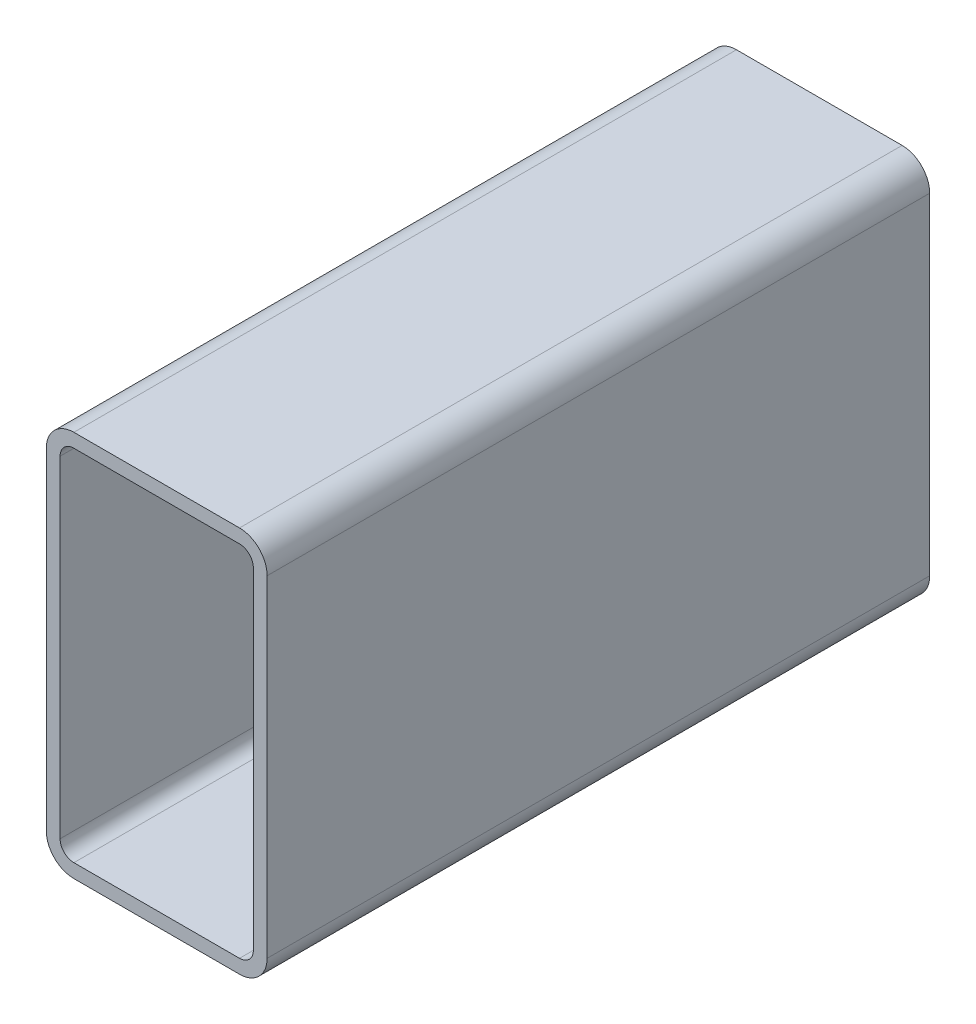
ISO-10303-21;
HEADER;
FILE_DESCRIPTION(('STEP AP214'),'2;1');
FILE_NAME('part.step','',(''),(''),'','','');
FILE_SCHEMA(('AUTOMOTIVE_DESIGN { 1 0 10303 214 1 1 1 1 }'));
ENDSEC;
DATA;
#1=APPLICATION_CONTEXT('core data for automotive mechanical design processes');
#2=APPLICATION_PROTOCOL_DEFINITION('international standard','automotive_design',2000,#1);
#3=PRODUCT_CONTEXT('',#1,'mechanical');
#4=PRODUCT('Part','Part','',(#3));
#5=PRODUCT_RELATED_PRODUCT_CATEGORY('part','',(#4));
#6=PRODUCT_DEFINITION_FORMATION('','',#4);
#7=PRODUCT_DEFINITION_CONTEXT('part definition',#1,'design');
#8=PRODUCT_DEFINITION('design','',#6,#7);
#9=PRODUCT_DEFINITION_SHAPE('','',#8);
#10=(LENGTH_UNIT() NAMED_UNIT(*) SI_UNIT(.MILLI.,.METRE.));
#11=(NAMED_UNIT(*) PLANE_ANGLE_UNIT() SI_UNIT($,.RADIAN.));
#12=(NAMED_UNIT(*) SI_UNIT($,.STERADIAN.) SOLID_ANGLE_UNIT());
#13=UNCERTAINTY_MEASURE_WITH_UNIT(LENGTH_MEASURE(1.E-05),#10,'distance_accuracy_value','');
#14=(GEOMETRIC_REPRESENTATION_CONTEXT(3) GLOBAL_UNCERTAINTY_ASSIGNED_CONTEXT((#13)) GLOBAL_UNIT_ASSIGNED_CONTEXT((#10,
#11,#12)) REPRESENTATION_CONTEXT('',''));
#15=CARTESIAN_POINT('',(0.,0.,0.));
#16=DIRECTION('',(0.,0.,1.));
#17=DIRECTION('',(1.,0.,0.));
#18=AXIS2_PLACEMENT_3D('',#15,#16,#17);
#19=CARTESIAN_POINT('',(14.3751778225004,167.089039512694,304.8));
#20=DIRECTION('',(0.,0.,1.));
#21=DIRECTION('',(1.,0.,0.));
#22=AXIS2_PLACEMENT_3D('',#19,#20,#21);
#23=PLANE('',#22);
#24=CARTESIAN_POINT('',(14.3751778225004,167.089039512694,304.8));
#25=DIRECTION('',(0.,0.,1.));
#26=DIRECTION('',(1.,0.,0.));
#27=AXIS2_PLACEMENT_3D('',#24,#25,#26);
#28=CIRCLE('',#27,12.7);
#29=CARTESIAN_POINT('',(14.3751778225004,179.789039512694,304.8));
#30=VERTEX_POINT('',#29);
#31=CARTESIAN_POINT('',(1.67517782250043,167.089039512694,304.8));
#32=VERTEX_POINT('',#31);
#33=EDGE_CURVE('E211',#30,#32,#28,.T.);
#34=ORIENTED_EDGE('',*,*,#33,.T.);
#35=DIRECTION('',(0.,-1.,0.));
#36=VECTOR('',#35,1.);
#37=CARTESIAN_POINT('',(1.67517782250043,14.6890395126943,304.8));
#38=LINE('',#37,#36);
#39=CARTESIAN_POINT('',(1.67517782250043,14.6890395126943,304.8));
#40=VERTEX_POINT('',#39);
#41=EDGE_CURVE('E214',#32,#40,#38,.T.);
#42=ORIENTED_EDGE('',*,*,#41,.T.);
#43=CARTESIAN_POINT('',(14.3751778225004,14.6890395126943,304.8));
#44=DIRECTION('',(0.,0.,1.));
#45=DIRECTION('',(1.,0.,0.));
#46=AXIS2_PLACEMENT_3D('',#43,#44,#45);
#47=CIRCLE('',#46,12.7);
#48=CARTESIAN_POINT('',(14.3751778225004,1.98903951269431,304.8));
#49=VERTEX_POINT('',#48);
#50=EDGE_CURVE('E217',#40,#49,#47,.T.);
#51=ORIENTED_EDGE('',*,*,#50,.T.);
#52=DIRECTION('',(1.,0.,0.));
#53=VECTOR('',#52,1.);
#54=CARTESIAN_POINT('',(90.5751778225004,1.98903951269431,304.8));
#55=LINE('',#54,#53);
#56=CARTESIAN_POINT('',(90.5751778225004,1.98903951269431,304.8));
#57=VERTEX_POINT('',#56);
#58=EDGE_CURVE('E219',#49,#57,#55,.T.);
#59=ORIENTED_EDGE('',*,*,#58,.T.);
#60=CARTESIAN_POINT('',(90.5751778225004,14.6890395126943,304.8));
#61=DIRECTION('',(0.,0.,1.));
#62=DIRECTION('',(1.,0.,0.));
#63=AXIS2_PLACEMENT_3D('',#60,#61,#62);
#64=CIRCLE('',#63,12.7);
#65=CARTESIAN_POINT('',(103.2751778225,14.6890395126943,304.8));
#66=VERTEX_POINT('',#65);
#67=EDGE_CURVE('E221',#57,#66,#64,.T.);
#68=ORIENTED_EDGE('',*,*,#67,.T.);
#69=DIRECTION('',(0.,1.,0.));
#70=VECTOR('',#69,1.);
#71=CARTESIAN_POINT('',(103.2751778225,167.089039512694,304.8));
#72=LINE('',#71,#70);
#73=CARTESIAN_POINT('',(103.2751778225,167.089039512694,304.8));
#74=VERTEX_POINT('',#73);
#75=EDGE_CURVE('E223',#66,#74,#72,.T.);
#76=ORIENTED_EDGE('',*,*,#75,.T.);
#77=CARTESIAN_POINT('',(90.5751778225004,167.089039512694,304.8));
#78=DIRECTION('',(0.,0.,1.));
#79=DIRECTION('',(1.,0.,0.));
#80=AXIS2_PLACEMENT_3D('',#77,#78,#79);
#81=CIRCLE('',#80,12.7);
#82=CARTESIAN_POINT('',(90.5751778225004,179.789039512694,304.8));
#83=VERTEX_POINT('',#82);
#84=EDGE_CURVE('E225',#74,#83,#81,.T.);
#85=ORIENTED_EDGE('',*,*,#84,.T.);
#86=DIRECTION('',(-1.,0.,0.));
#87=VECTOR('',#86,1.);
#88=CARTESIAN_POINT('',(14.3751778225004,179.789039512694,304.8));
#89=LINE('',#88,#87);
#90=EDGE_CURVE('E227',#83,#30,#89,.T.);
#91=ORIENTED_EDGE('',*,*,#90,.T.);
#92=EDGE_LOOP('',(#34,#42,#51,#59,#68,#76,#85,#91));
#93=FACE_BOUND('',#92,.T.);
#94=DIRECTION('',(0.,-1.,0.));
#95=VECTOR('',#94,1.);
#96=CARTESIAN_POINT('',(8.02517782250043,14.6890395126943,304.8));
#97=LINE('',#96,#95);
#98=CARTESIAN_POINT('',(8.02517782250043,167.089039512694,304.8));
#99=VERTEX_POINT('',#98);
#100=CARTESIAN_POINT('',(8.02517782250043,14.6890395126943,304.8));
#101=VERTEX_POINT('',#100);
#102=EDGE_CURVE('E154',#99,#101,#97,.T.);
#103=ORIENTED_EDGE('',*,*,#102,.F.);
#104=CARTESIAN_POINT('',(14.3751778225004,167.089039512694,304.8));
#105=DIRECTION('',(0.,0.,1.));
#106=DIRECTION('',(1.,0.,0.));
#107=AXIS2_PLACEMENT_3D('',#104,#105,#106);
#108=CIRCLE('',#107,6.35);
#109=CARTESIAN_POINT('',(14.3751778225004,173.439039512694,304.8));
#110=VERTEX_POINT('',#109);
#111=EDGE_CURVE('E146',#110,#99,#108,.T.);
#112=ORIENTED_EDGE('',*,*,#111,.F.);
#113=DIRECTION('',(-1.,0.,0.));
#114=VECTOR('',#113,1.);
#115=CARTESIAN_POINT('',(14.3751778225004,173.439039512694,304.8));
#116=LINE('',#115,#114);
#117=CARTESIAN_POINT('',(90.5751778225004,173.439039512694,304.8));
#118=VERTEX_POINT('',#117);
#119=EDGE_CURVE('E179',#118,#110,#116,.T.);
#120=ORIENTED_EDGE('',*,*,#119,.F.);
#121=CARTESIAN_POINT('',(90.5751778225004,167.089039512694,304.8));
#122=DIRECTION('',(0.,0.,1.));
#123=DIRECTION('',(1.,0.,0.));
#124=AXIS2_PLACEMENT_3D('',#121,#122,#123);
#125=CIRCLE('',#124,6.34999999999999);
#126=CARTESIAN_POINT('',(96.9251778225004,167.089039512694,304.8));
#127=VERTEX_POINT('',#126);
#128=EDGE_CURVE('E177',#127,#118,#125,.T.);
#129=ORIENTED_EDGE('',*,*,#128,.F.);
#130=DIRECTION('',(0.,1.,0.));
#131=VECTOR('',#130,1.);
#132=CARTESIAN_POINT('',(96.9251778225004,167.089039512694,304.8));
#133=LINE('',#132,#131);
#134=CARTESIAN_POINT('',(96.9251778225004,14.6890395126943,304.8));
#135=VERTEX_POINT('',#134);
#136=EDGE_CURVE('E175',#135,#127,#133,.T.);
#137=ORIENTED_EDGE('',*,*,#136,.F.);
#138=CARTESIAN_POINT('',(90.5751778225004,14.6890395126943,304.8));
#139=DIRECTION('',(0.,0.,1.));
#140=DIRECTION('',(1.,0.,0.));
#141=AXIS2_PLACEMENT_3D('',#138,#139,#140);
#142=CIRCLE('',#141,6.35000000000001);
#143=CARTESIAN_POINT('',(90.5751778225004,8.3390395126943,304.8));
#144=VERTEX_POINT('',#143);
#145=EDGE_CURVE('E173',#144,#135,#142,.T.);
#146=ORIENTED_EDGE('',*,*,#145,.F.);
#147=DIRECTION('',(1.,0.,0.));
#148=VECTOR('',#147,1.);
#149=CARTESIAN_POINT('',(90.5751778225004,8.33903951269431,304.8));
#150=LINE('',#149,#148);
#151=CARTESIAN_POINT('',(14.3751778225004,8.33903951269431,304.8));
#152=VERTEX_POINT('',#151);
#153=EDGE_CURVE('E169',#152,#144,#150,.T.);
#154=ORIENTED_EDGE('',*,*,#153,.F.);
#155=CARTESIAN_POINT('',(14.3751778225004,14.6890395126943,304.8));
#156=DIRECTION('',(0.,0.,1.));
#157=DIRECTION('',(1.,0.,0.));
#158=AXIS2_PLACEMENT_3D('',#155,#156,#157);
#159=CIRCLE('',#158,6.35);
#160=EDGE_CURVE('E167',#101,#152,#159,.T.);
#161=ORIENTED_EDGE('',*,*,#160,.F.);
#162=EDGE_LOOP('',(#103,#112,#120,#129,#137,#146,#154,#161));
#163=FACE_BOUND('',#162,.T.);
#164=ADVANCED_FACE('F33',(#93,#163),#23,.T.);
#165=CARTESIAN_POINT('',(14.3751778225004,167.089039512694,0.));
#166=DIRECTION('',(0.,0.,1.));
#167=DIRECTION('',(1.,0.,0.));
#168=AXIS2_PLACEMENT_3D('',#165,#166,#167);
#169=PLANE('',#168);
#170=CARTESIAN_POINT('',(14.3751778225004,167.089039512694,0.));
#171=DIRECTION('',(0.,0.,1.));
#172=DIRECTION('',(1.,0.,0.));
#173=AXIS2_PLACEMENT_3D('',#170,#171,#172);
#174=CIRCLE('',#173,12.7);
#175=CARTESIAN_POINT('',(14.3751778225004,179.789039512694,0.));
#176=VERTEX_POINT('',#175);
#177=CARTESIAN_POINT('',(1.67517782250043,167.089039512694,0.));
#178=VERTEX_POINT('',#177);
#179=EDGE_CURVE('E162',#176,#178,#174,.T.);
#180=ORIENTED_EDGE('',*,*,#179,.F.);
#181=DIRECTION('',(-1.,0.,0.));
#182=VECTOR('',#181,1.);
#183=CARTESIAN_POINT('',(14.3751778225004,179.789039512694,0.));
#184=LINE('',#183,#182);
#185=CARTESIAN_POINT('',(90.5751778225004,179.789039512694,0.));
#186=VERTEX_POINT('',#185);
#187=EDGE_CURVE('E215',#186,#176,#184,.T.);
#188=ORIENTED_EDGE('',*,*,#187,.F.);
#189=CARTESIAN_POINT('',(90.5751778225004,167.089039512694,0.));
#190=DIRECTION('',(0.,0.,1.));
#191=DIRECTION('',(1.,0.,0.));
#192=AXIS2_PLACEMENT_3D('',#189,#190,#191);
#193=CIRCLE('',#192,12.7);
#194=CARTESIAN_POINT('',(103.2751778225,167.089039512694,0.));
#195=VERTEX_POINT('',#194);
#196=EDGE_CURVE('E242',#195,#186,#193,.T.);
#197=ORIENTED_EDGE('',*,*,#196,.F.);
#198=DIRECTION('',(0.,1.,0.));
#199=VECTOR('',#198,1.);
#200=CARTESIAN_POINT('',(103.2751778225,167.089039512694,0.));
#201=LINE('',#200,#199);
#202=CARTESIAN_POINT('',(103.2751778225,14.6890395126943,0.));
#203=VERTEX_POINT('',#202);
#204=EDGE_CURVE('E240',#203,#195,#201,.T.);
#205=ORIENTED_EDGE('',*,*,#204,.F.);
#206=CARTESIAN_POINT('',(90.5751778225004,14.6890395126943,0.));
#207=DIRECTION('',(0.,0.,1.));
#208=DIRECTION('',(1.,0.,0.));
#209=AXIS2_PLACEMENT_3D('',#206,#207,#208);
#210=CIRCLE('',#209,12.7);
#211=CARTESIAN_POINT('',(90.5751778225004,1.98903951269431,0.));
#212=VERTEX_POINT('',#211);
#213=EDGE_CURVE('E238',#212,#203,#210,.T.);
#214=ORIENTED_EDGE('',*,*,#213,.F.);
#215=DIRECTION('',(1.,0.,0.));
#216=VECTOR('',#215,1.);
#217=CARTESIAN_POINT('',(90.5751778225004,1.98903951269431,0.));
#218=LINE('',#217,#216);
#219=CARTESIAN_POINT('',(14.3751778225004,1.98903951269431,0.));
#220=VERTEX_POINT('',#219);
#221=EDGE_CURVE('E236',#220,#212,#218,.T.);
#222=ORIENTED_EDGE('',*,*,#221,.F.);
#223=CARTESIAN_POINT('',(14.3751778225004,14.6890395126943,0.));
#224=DIRECTION('',(0.,0.,1.));
#225=DIRECTION('',(1.,0.,0.));
#226=AXIS2_PLACEMENT_3D('',#223,#224,#225);
#227=CIRCLE('',#226,12.7);
#228=CARTESIAN_POINT('',(1.67517782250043,14.6890395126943,0.));
#229=VERTEX_POINT('',#228);
#230=EDGE_CURVE('E234',#229,#220,#227,.T.);
#231=ORIENTED_EDGE('',*,*,#230,.F.);
#232=DIRECTION('',(0.,-1.,0.));
#233=VECTOR('',#232,1.);
#234=CARTESIAN_POINT('',(1.67517782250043,14.6890395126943,0.));
#235=LINE('',#234,#233);
#236=EDGE_CURVE('E232',#178,#229,#235,.T.);
#237=ORIENTED_EDGE('',*,*,#236,.F.);
#238=EDGE_LOOP('',(#180,#188,#197,#205,#214,#222,#231,#237));
#239=FACE_BOUND('',#238,.T.);
#240=CARTESIAN_POINT('',(14.3751778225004,167.089039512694,0.));
#241=DIRECTION('',(0.,0.,1.));
#242=DIRECTION('',(1.,0.,0.));
#243=AXIS2_PLACEMENT_3D('',#240,#241,#242);
#244=CIRCLE('',#243,6.35);
#245=CARTESIAN_POINT('',(14.3751778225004,173.439039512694,0.));
#246=VERTEX_POINT('',#245);
#247=CARTESIAN_POINT('',(8.02517782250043,167.089039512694,0.));
#248=VERTEX_POINT('',#247);
#249=EDGE_CURVE('E56',#246,#248,#244,.T.);
#250=ORIENTED_EDGE('',*,*,#249,.T.);
#251=DIRECTION('',(0.,-1.,0.));
#252=VECTOR('',#251,1.);
#253=CARTESIAN_POINT('',(8.02517782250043,14.6890395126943,0.));
#254=LINE('',#253,#252);
#255=CARTESIAN_POINT('',(8.02517782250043,14.6890395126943,0.));
#256=VERTEX_POINT('',#255);
#257=EDGE_CURVE('E161',#248,#256,#254,.T.);
#258=ORIENTED_EDGE('',*,*,#257,.T.);
#259=CARTESIAN_POINT('',(14.3751778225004,14.6890395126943,0.));
#260=DIRECTION('',(0.,0.,1.));
#261=DIRECTION('',(1.,0.,0.));
#262=AXIS2_PLACEMENT_3D('',#259,#260,#261);
#263=CIRCLE('',#262,6.35);
#264=CARTESIAN_POINT('',(14.3751778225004,8.33903951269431,0.));
#265=VERTEX_POINT('',#264);
#266=EDGE_CURVE('E183',#256,#265,#263,.T.);
#267=ORIENTED_EDGE('',*,*,#266,.T.);
#268=DIRECTION('',(1.,0.,0.));
#269=VECTOR('',#268,1.);
#270=CARTESIAN_POINT('',(90.5751778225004,8.33903951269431,0.));
#271=LINE('',#270,#269);
#272=CARTESIAN_POINT('',(90.5751778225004,8.3390395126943,0.));
#273=VERTEX_POINT('',#272);
#274=EDGE_CURVE('E186',#265,#273,#271,.T.);
#275=ORIENTED_EDGE('',*,*,#274,.T.);
#276=CARTESIAN_POINT('',(90.5751778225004,14.6890395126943,0.));
#277=DIRECTION('',(0.,0.,1.));
#278=DIRECTION('',(1.,0.,0.));
#279=AXIS2_PLACEMENT_3D('',#276,#277,#278);
#280=CIRCLE('',#279,6.35000000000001);
#281=CARTESIAN_POINT('',(96.9251778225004,14.6890395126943,0.));
#282=VERTEX_POINT('',#281);
#283=EDGE_CURVE('E189',#273,#282,#280,.T.);
#284=ORIENTED_EDGE('',*,*,#283,.T.);
#285=DIRECTION('',(0.,1.,0.));
#286=VECTOR('',#285,1.);
#287=CARTESIAN_POINT('',(96.9251778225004,167.089039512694,0.));
#288=LINE('',#287,#286);
#289=CARTESIAN_POINT('',(96.9251778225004,167.089039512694,0.));
#290=VERTEX_POINT('',#289);
#291=EDGE_CURVE('E192',#282,#290,#288,.T.);
#292=ORIENTED_EDGE('',*,*,#291,.T.);
#293=CARTESIAN_POINT('',(90.5751778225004,167.089039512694,0.));
#294=DIRECTION('',(0.,0.,1.));
#295=DIRECTION('',(1.,0.,0.));
#296=AXIS2_PLACEMENT_3D('',#293,#294,#295);
#297=CIRCLE('',#296,6.34999999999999);
#298=CARTESIAN_POINT('',(90.5751778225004,173.439039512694,0.));
#299=VERTEX_POINT('',#298);
#300=EDGE_CURVE('E195',#290,#299,#297,.T.);
#301=ORIENTED_EDGE('',*,*,#300,.T.);
#302=DIRECTION('',(-1.,0.,0.));
#303=VECTOR('',#302,1.);
#304=CARTESIAN_POINT('',(14.3751778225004,173.439039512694,0.));
#305=LINE('',#304,#303);
#306=EDGE_CURVE('E155',#299,#246,#305,.T.);
#307=ORIENTED_EDGE('',*,*,#306,.T.);
#308=EDGE_LOOP('',(#250,#258,#267,#275,#284,#292,#301,#307));
#309=FACE_BOUND('',#308,.T.);
#310=ADVANCED_FACE('F272',(#239,#309),#169,.F.);
#311=CARTESIAN_POINT('',(14.3751778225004,167.089039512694,304.8));
#312=DIRECTION('',(0.,0.,-1.));
#313=DIRECTION('',(-1.,0.,0.));
#314=AXIS2_PLACEMENT_3D('',#311,#312,#313);
#315=CYLINDRICAL_SURFACE('',#314,12.7);
#316=ORIENTED_EDGE('',*,*,#179,.T.);
#317=DIRECTION('',(0.,0.,-1.));
#318=VECTOR('',#317,1.);
#319=CARTESIAN_POINT('',(1.67517782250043,167.089039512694,304.8));
#320=LINE('',#319,#318);
#321=EDGE_CURVE('E11',#32,#178,#320,.T.);
#322=ORIENTED_EDGE('',*,*,#321,.F.);
#323=ORIENTED_EDGE('',*,*,#33,.F.);
#324=DIRECTION('',(0.,0.,-1.));
#325=VECTOR('',#324,1.);
#326=CARTESIAN_POINT('',(14.3751778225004,179.789039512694,304.8));
#327=LINE('',#326,#325);
#328=EDGE_CURVE('E229',#30,#176,#327,.T.);
#329=ORIENTED_EDGE('',*,*,#328,.T.);
#330=EDGE_LOOP('',(#316,#322,#323,#329));
#331=FACE_BOUND('',#330,.T.);
#332=ADVANCED_FACE('F35',(#331),#315,.T.);
#333=CARTESIAN_POINT('',(1.67517782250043,14.6890395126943,304.8));
#334=DIRECTION('',(1.,0.,0.));
#335=DIRECTION('',(0.,0.,-1.));
#336=AXIS2_PLACEMENT_3D('',#333,#334,#335);
#337=PLANE('',#336);
#338=ORIENTED_EDGE('',*,*,#236,.T.);
#339=DIRECTION('',(0.,0.,-1.));
#340=VECTOR('',#339,1.);
#341=CARTESIAN_POINT('',(1.67517782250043,14.6890395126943,304.8));
#342=LINE('',#341,#340);
#343=EDGE_CURVE('E41',#40,#229,#342,.T.);
#344=ORIENTED_EDGE('',*,*,#343,.F.);
#345=ORIENTED_EDGE('',*,*,#41,.F.);
#346=ORIENTED_EDGE('',*,*,#321,.T.);
#347=EDGE_LOOP('',(#338,#344,#345,#346));
#348=FACE_BOUND('',#347,.T.);
#349=ADVANCED_FACE('F289',(#348),#337,.F.);
#350=CARTESIAN_POINT('',(14.3751778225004,14.6890395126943,304.8));
#351=DIRECTION('',(0.,0.,-1.));
#352=DIRECTION('',(-1.,0.,0.));
#353=AXIS2_PLACEMENT_3D('',#350,#351,#352);
#354=CYLINDRICAL_SURFACE('',#353,12.7);
#355=ORIENTED_EDGE('',*,*,#230,.T.);
#356=DIRECTION('',(0.,0.,-1.));
#357=VECTOR('',#356,1.);
#358=CARTESIAN_POINT('',(14.3751778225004,1.98903951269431,304.8));
#359=LINE('',#358,#357);
#360=EDGE_CURVE('E259',#49,#220,#359,.T.);
#361=ORIENTED_EDGE('',*,*,#360,.F.);
#362=ORIENTED_EDGE('',*,*,#50,.F.);
#363=ORIENTED_EDGE('',*,*,#343,.T.);
#364=EDGE_LOOP('',(#355,#361,#362,#363));
#365=FACE_BOUND('',#364,.T.);
#366=ADVANCED_FACE('F266',(#365),#354,.T.);
#367=CARTESIAN_POINT('',(90.5751778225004,1.98903951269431,304.8));
#368=DIRECTION('',(0.,1.,0.));
#369=DIRECTION('',(0.,0.,1.));
#370=AXIS2_PLACEMENT_3D('',#367,#368,#369);
#371=PLANE('',#370);
#372=ORIENTED_EDGE('',*,*,#221,.T.);
#373=DIRECTION('',(0.,0.,-1.));
#374=VECTOR('',#373,1.);
#375=CARTESIAN_POINT('',(90.5751778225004,1.98903951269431,304.8));
#376=LINE('',#375,#374);
#377=EDGE_CURVE('E256',#57,#212,#376,.T.);
#378=ORIENTED_EDGE('',*,*,#377,.F.);
#379=ORIENTED_EDGE('',*,*,#58,.F.);
#380=ORIENTED_EDGE('',*,*,#360,.T.);
#381=EDGE_LOOP('',(#372,#378,#379,#380));
#382=FACE_BOUND('',#381,.T.);
#383=ADVANCED_FACE('F278',(#382),#371,.F.);
#384=CARTESIAN_POINT('',(90.5751778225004,14.6890395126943,304.8));
#385=DIRECTION('',(0.,0.,-1.));
#386=DIRECTION('',(-1.,0.,0.));
#387=AXIS2_PLACEMENT_3D('',#384,#385,#386);
#388=CYLINDRICAL_SURFACE('',#387,12.7);
#389=ORIENTED_EDGE('',*,*,#213,.T.);
#390=DIRECTION('',(0.,0.,-1.));
#391=VECTOR('',#390,1.);
#392=CARTESIAN_POINT('',(103.2751778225,14.6890395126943,304.8));
#393=LINE('',#392,#391);
#394=EDGE_CURVE('E253',#66,#203,#393,.T.);
#395=ORIENTED_EDGE('',*,*,#394,.F.);
#396=ORIENTED_EDGE('',*,*,#67,.F.);
#397=ORIENTED_EDGE('',*,*,#377,.T.);
#398=EDGE_LOOP('',(#389,#395,#396,#397));
#399=FACE_BOUND('',#398,.T.);
#400=ADVANCED_FACE('F282',(#399),#388,.T.);
#401=CARTESIAN_POINT('',(103.2751778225,167.089039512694,304.8));
#402=DIRECTION('',(-1.,0.,0.));
#403=DIRECTION('',(0.,0.,1.));
#404=AXIS2_PLACEMENT_3D('',#401,#402,#403);
#405=PLANE('',#404);
#406=ORIENTED_EDGE('',*,*,#204,.T.);
#407=DIRECTION('',(0.,0.,-1.));
#408=VECTOR('',#407,1.);
#409=CARTESIAN_POINT('',(103.2751778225,167.089039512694,304.8));
#410=LINE('',#409,#408);
#411=EDGE_CURVE('E250',#74,#195,#410,.T.);
#412=ORIENTED_EDGE('',*,*,#411,.F.);
#413=ORIENTED_EDGE('',*,*,#75,.F.);
#414=ORIENTED_EDGE('',*,*,#394,.T.);
#415=EDGE_LOOP('',(#406,#412,#413,#414));
#416=FACE_BOUND('',#415,.T.);
#417=ADVANCED_FACE('F302',(#416),#405,.F.);
#418=CARTESIAN_POINT('',(90.5751778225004,167.089039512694,304.8));
#419=DIRECTION('',(0.,0.,-1.));
#420=DIRECTION('',(-1.,0.,0.));
#421=AXIS2_PLACEMENT_3D('',#418,#419,#420);
#422=CYLINDRICAL_SURFACE('',#421,12.7);
#423=ORIENTED_EDGE('',*,*,#196,.T.);
#424=DIRECTION('',(0.,0.,-1.));
#425=VECTOR('',#424,1.);
#426=CARTESIAN_POINT('',(90.5751778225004,179.789039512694,304.8));
#427=LINE('',#426,#425);
#428=EDGE_CURVE('E247',#83,#186,#427,.T.);
#429=ORIENTED_EDGE('',*,*,#428,.F.);
#430=ORIENTED_EDGE('',*,*,#84,.F.);
#431=ORIENTED_EDGE('',*,*,#411,.T.);
#432=EDGE_LOOP('',(#423,#429,#430,#431));
#433=FACE_BOUND('',#432,.T.);
#434=ADVANCED_FACE('F300',(#433),#422,.T.);
#435=CARTESIAN_POINT('',(14.3751778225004,179.789039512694,304.8));
#436=DIRECTION('',(0.,-1.,0.));
#437=DIRECTION('',(0.,0.,-1.));
#438=AXIS2_PLACEMENT_3D('',#435,#436,#437);
#439=PLANE('',#438);
#440=ORIENTED_EDGE('',*,*,#187,.T.);
#441=ORIENTED_EDGE('',*,*,#328,.F.);
#442=ORIENTED_EDGE('',*,*,#90,.F.);
#443=ORIENTED_EDGE('',*,*,#428,.T.);
#444=EDGE_LOOP('',(#440,#441,#442,#443));
#445=FACE_BOUND('',#444,.T.);
#446=ADVANCED_FACE('F295',(#445),#439,.F.);
#447=CARTESIAN_POINT('',(14.3751778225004,167.089039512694,304.8));
#448=DIRECTION('',(0.,0.,-1.));
#449=DIRECTION('',(-1.,0.,0.));
#450=AXIS2_PLACEMENT_3D('',#447,#448,#449);
#451=CYLINDRICAL_SURFACE('',#450,6.35);
#452=ORIENTED_EDGE('',*,*,#249,.F.);
#453=DIRECTION('',(0.,0.,-1.));
#454=VECTOR('',#453,1.);
#455=CARTESIAN_POINT('',(14.3751778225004,173.439039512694,304.8));
#456=LINE('',#455,#454);
#457=EDGE_CURVE('E150',#110,#246,#456,.T.);
#458=ORIENTED_EDGE('',*,*,#457,.F.);
#459=ORIENTED_EDGE('',*,*,#111,.T.);
#460=DIRECTION('',(0.,0.,-1.));
#461=VECTOR('',#460,1.);
#462=CARTESIAN_POINT('',(8.02517782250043,167.089039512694,304.8));
#463=LINE('',#462,#461);
#464=EDGE_CURVE('E149',#99,#248,#463,.T.);
#465=ORIENTED_EDGE('',*,*,#464,.T.);
#466=EDGE_LOOP('',(#452,#458,#459,#465));
#467=FACE_BOUND('',#466,.T.);
#468=ADVANCED_FACE('F148',(#467),#451,.F.);
#469=CARTESIAN_POINT('',(8.02517782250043,14.6890395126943,304.8));
#470=DIRECTION('',(1.,0.,0.));
#471=DIRECTION('',(0.,0.,-1.));
#472=AXIS2_PLACEMENT_3D('',#469,#470,#471);
#473=PLANE('',#472);
#474=ORIENTED_EDGE('',*,*,#257,.F.);
#475=ORIENTED_EDGE('',*,*,#464,.F.);
#476=ORIENTED_EDGE('',*,*,#102,.T.);
#477=DIRECTION('',(0.,0.,-1.));
#478=VECTOR('',#477,1.);
#479=CARTESIAN_POINT('',(8.02517782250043,14.6890395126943,304.8));
#480=LINE('',#479,#478);
#481=EDGE_CURVE('E163',#101,#256,#480,.T.);
#482=ORIENTED_EDGE('',*,*,#481,.T.);
#483=EDGE_LOOP('',(#474,#475,#476,#482));
#484=FACE_BOUND('',#483,.T.);
#485=ADVANCED_FACE('F158',(#484),#473,.T.);
#486=CARTESIAN_POINT('',(14.3751778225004,14.6890395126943,304.8));
#487=DIRECTION('',(0.,0.,-1.));
#488=DIRECTION('',(-1.,0.,0.));
#489=AXIS2_PLACEMENT_3D('',#486,#487,#488);
#490=CYLINDRICAL_SURFACE('',#489,6.35);
#491=ORIENTED_EDGE('',*,*,#266,.F.);
#492=ORIENTED_EDGE('',*,*,#481,.F.);
#493=ORIENTED_EDGE('',*,*,#160,.T.);
#494=DIRECTION('',(0.,0.,-1.));
#495=VECTOR('',#494,1.);
#496=CARTESIAN_POINT('',(14.3751778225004,8.33903951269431,304.8));
#497=LINE('',#496,#495);
#498=EDGE_CURVE('E208',#152,#265,#497,.T.);
#499=ORIENTED_EDGE('',*,*,#498,.T.);
#500=EDGE_LOOP('',(#491,#492,#493,#499));
#501=FACE_BOUND('',#500,.T.);
#502=ADVANCED_FACE('F327',(#501),#490,.F.);
#503=CARTESIAN_POINT('',(90.5751778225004,8.33903951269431,304.8));
#504=DIRECTION('',(0.,1.,0.));
#505=DIRECTION('',(0.,0.,1.));
#506=AXIS2_PLACEMENT_3D('',#503,#504,#505);
#507=PLANE('',#506);
#508=ORIENTED_EDGE('',*,*,#274,.F.);
#509=ORIENTED_EDGE('',*,*,#498,.F.);
#510=ORIENTED_EDGE('',*,*,#153,.T.);
#511=DIRECTION('',(0.,0.,-1.));
#512=VECTOR('',#511,1.);
#513=CARTESIAN_POINT('',(90.5751778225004,8.3390395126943,304.8));
#514=LINE('',#513,#512);
#515=EDGE_CURVE('E206',#144,#273,#514,.T.);
#516=ORIENTED_EDGE('',*,*,#515,.T.);
#517=EDGE_LOOP('',(#508,#509,#510,#516));
#518=FACE_BOUND('',#517,.T.);
#519=ADVANCED_FACE('F331',(#518),#507,.T.);
#520=CARTESIAN_POINT('',(90.5751778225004,14.6890395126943,304.8));
#521=DIRECTION('',(0.,0.,-1.));
#522=DIRECTION('',(-1.,0.,0.));
#523=AXIS2_PLACEMENT_3D('',#520,#521,#522);
#524=CYLINDRICAL_SURFACE('',#523,6.35000000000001);
#525=ORIENTED_EDGE('',*,*,#283,.F.);
#526=ORIENTED_EDGE('',*,*,#515,.F.);
#527=ORIENTED_EDGE('',*,*,#145,.T.);
#528=DIRECTION('',(0.,0.,-1.));
#529=VECTOR('',#528,1.);
#530=CARTESIAN_POINT('',(96.9251778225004,14.6890395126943,304.8));
#531=LINE('',#530,#529);
#532=EDGE_CURVE('E204',#135,#282,#531,.T.);
#533=ORIENTED_EDGE('',*,*,#532,.T.);
#534=EDGE_LOOP('',(#525,#526,#527,#533));
#535=FACE_BOUND('',#534,.T.);
#536=ADVANCED_FACE('F337',(#535),#524,.F.);
#537=CARTESIAN_POINT('',(96.9251778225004,167.089039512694,304.8));
#538=DIRECTION('',(-1.,0.,0.));
#539=DIRECTION('',(0.,0.,1.));
#540=AXIS2_PLACEMENT_3D('',#537,#538,#539);
#541=PLANE('',#540);
#542=ORIENTED_EDGE('',*,*,#291,.F.);
#543=ORIENTED_EDGE('',*,*,#532,.F.);
#544=ORIENTED_EDGE('',*,*,#136,.T.);
#545=DIRECTION('',(0.,0.,-1.));
#546=VECTOR('',#545,1.);
#547=CARTESIAN_POINT('',(96.9251778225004,167.089039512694,304.8));
#548=LINE('',#547,#546);
#549=EDGE_CURVE('E202',#127,#290,#548,.T.);
#550=ORIENTED_EDGE('',*,*,#549,.T.);
#551=EDGE_LOOP('',(#542,#543,#544,#550));
#552=FACE_BOUND('',#551,.T.);
#553=ADVANCED_FACE('F341',(#552),#541,.T.);
#554=CARTESIAN_POINT('',(90.5751778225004,167.089039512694,304.8));
#555=DIRECTION('',(0.,0.,-1.));
#556=DIRECTION('',(-1.,0.,0.));
#557=AXIS2_PLACEMENT_3D('',#554,#555,#556);
#558=CYLINDRICAL_SURFACE('',#557,6.34999999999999);
#559=ORIENTED_EDGE('',*,*,#300,.F.);
#560=ORIENTED_EDGE('',*,*,#549,.F.);
#561=ORIENTED_EDGE('',*,*,#128,.T.);
#562=DIRECTION('',(0.,0.,-1.));
#563=VECTOR('',#562,1.);
#564=CARTESIAN_POINT('',(90.5751778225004,173.439039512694,304.8));
#565=LINE('',#564,#563);
#566=EDGE_CURVE('E48',#118,#299,#565,.T.);
#567=ORIENTED_EDGE('',*,*,#566,.T.);
#568=EDGE_LOOP('',(#559,#560,#561,#567));
#569=FACE_BOUND('',#568,.T.);
#570=ADVANCED_FACE('F345',(#569),#558,.F.);
#571=CARTESIAN_POINT('',(14.3751778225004,173.439039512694,304.8));
#572=DIRECTION('',(0.,-1.,0.));
#573=DIRECTION('',(0.,0.,-1.));
#574=AXIS2_PLACEMENT_3D('',#571,#572,#573);
#575=PLANE('',#574);
#576=ORIENTED_EDGE('',*,*,#306,.F.);
#577=ORIENTED_EDGE('',*,*,#566,.F.);
#578=ORIENTED_EDGE('',*,*,#119,.T.);
#579=ORIENTED_EDGE('',*,*,#457,.T.);
#580=EDGE_LOOP('',(#576,#577,#578,#579));
#581=FACE_BOUND('',#580,.T.);
#582=ADVANCED_FACE('F349',(#581),#575,.T.);
#583=CLOSED_SHELL('',(#164,#310,#332,#349,#366,#383,#400,#417,#434,#446,#468,#485,#502,#519,
#536,#553,#570,#582));
#584=MANIFOLD_SOLID_BREP('B2',#583);
#585=ADVANCED_BREP_SHAPE_REPRESENTATION('',(#18,#584),#14);
#586=SHAPE_DEFINITION_REPRESENTATION(#9,#585);
ENDSEC;
END-ISO-10303-21;
